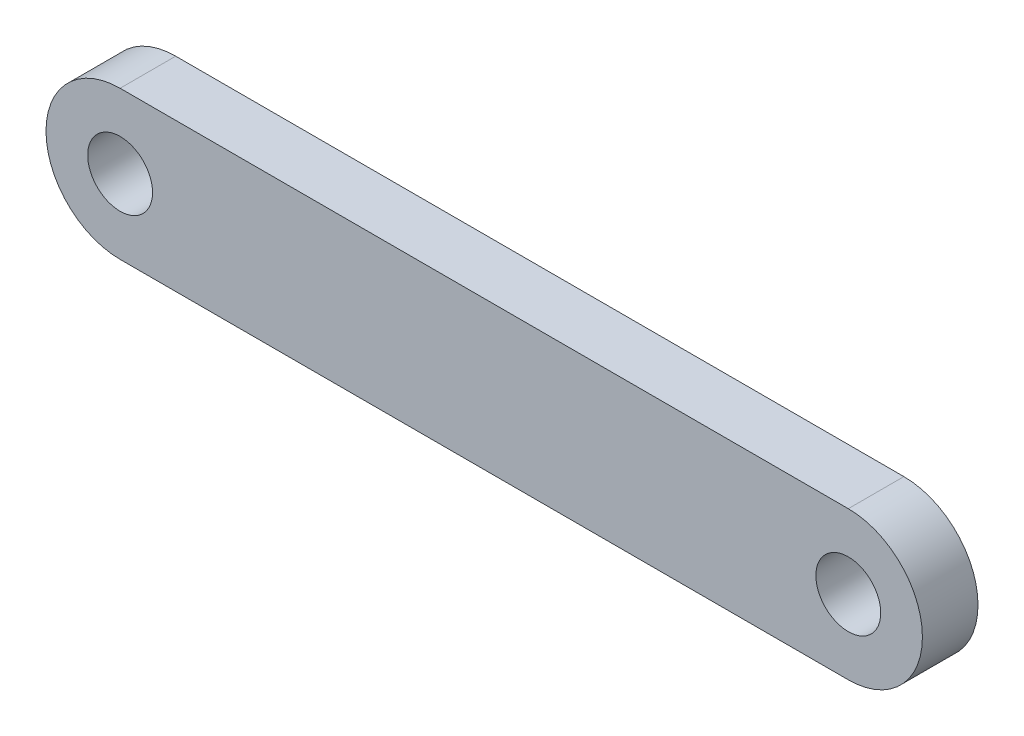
from build123d import *

# Parameters (mm, degrees)
ESQUISSE1_R        = 1.75
BOSS_EXTRU_1_DEPTH = 3


with BuildPart() as part:
    # Esquisse1 → Boss.-Extru.1 (new body)
    with BuildSketch(Plane.XY):
        with BuildLine():
            Line((-39.3, 4), (0, 4))
            ThreePointArc((0, 4), (4, 0), (0, -4))
            Line((0, -4), (-39.3, -4))
            ThreePointArc((-39.3, -4), (-43.3, 0), (-39.3, 4))
        make_face()
        Circle(ESQUISSE1_R, mode=Mode.SUBTRACT)
        with Locations((-39.3, 0)):
            Circle(ESQUISSE1_R, mode=Mode.SUBTRACT)
    extrude(amount=BOSS_EXTRU_1_DEPTH)


solid = part.part
